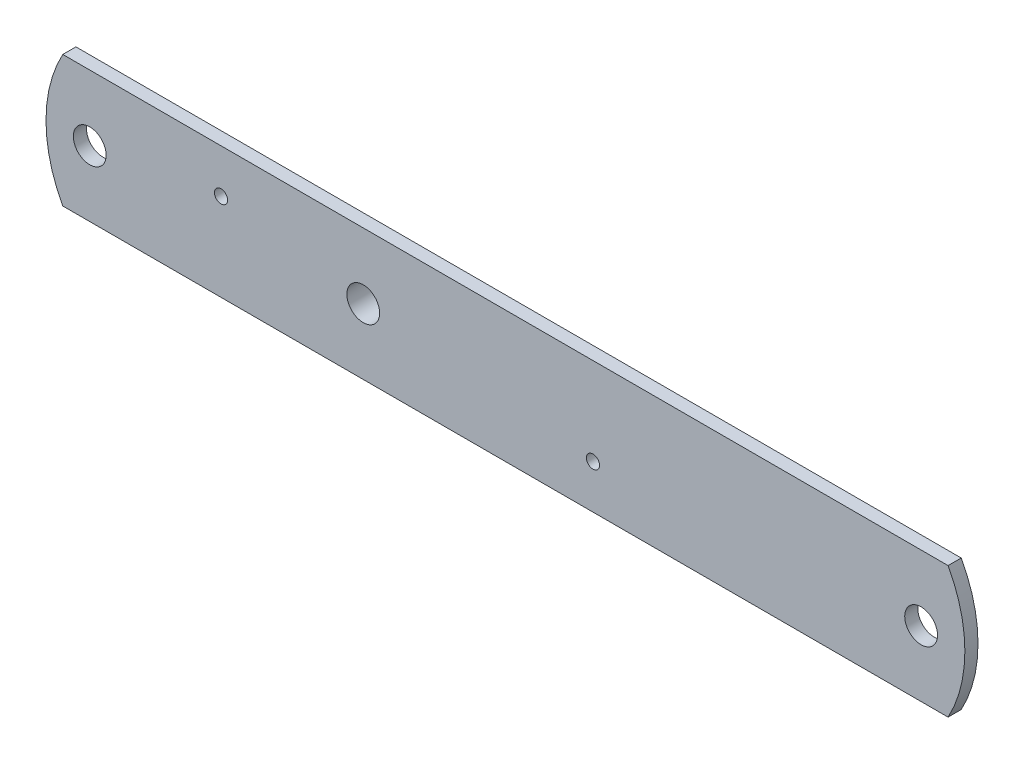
from build123d import *
from build123d.topology import SkipClean

# Parameters (mm, degrees)
ESQUISSE1_R             = 15
ESQUISSE1_R_2           = 6
EXTRUSION1_DEPTH        = 12
ESQUISSE2_W             = 100
ESQUISSE2_H             = 60
EXTRUSION2_DEPTH        = 10
ESQUISSE3_R             = 15
ENL_V_MAT_EXTRU_1_DEPTH = 849.813289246


with BuildPart() as part:
    # Esquisse1 → Extrusion1 (new body)
    with BuildSketch(Plane.XY):
        with BuildLine():
            Line((15.341439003, 0), (824.658560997, 0))
            ThreePointArc((824.658560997, 0), (840, -60), (824.658560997, -120))
            Line((824.658560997, -120), (15.341439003, -120))
            ThreePointArc((15.341439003, -120), (0, -60), (15.341439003, 0))
        make_face()
        with Locations((40, -60)):
            Circle(ESQUISSE1_R, mode=Mode.SUBTRACT)
        with Locations((160, -40)):
            Circle(ESQUISSE1_R_2, mode=Mode.SUBTRACT)
        with Locations((290, -60)):
            Circle(ESQUISSE1_R, mode=Mode.SUBTRACT)
        with Locations((800, -60)):
            Circle(ESQUISSE1_R, mode=Mode.SUBTRACT)
        with Locations((500, -80)):
            Circle(ESQUISSE1_R_2, mode=Mode.SUBTRACT)
    extrude(amount=EXTRUSION1_DEPTH)

    # Esquisse2 → Extrusion2 (add)
    with BuildSketch(Plane(origin=(0, 0, 0), x_dir=(-1, 0, 0), z_dir=(0, 0, -1))):
        with Locations((-290, -60)):
            Rectangle(ESQUISSE2_W, ESQUISSE2_H)
    extrude(amount=EXTRUSION2_DEPTH)

    # Esquisse3 → Enl_v. mat.-Extru.1 (cut, through all)
    with SkipClean():  # the faces are left unmerged after this step: merging them gives an invalid solid
        with BuildSketch(Plane(origin=(0, 0, -10), x_dir=(-1, 0, 0), z_dir=(0, 0, -1))):
            with Locations((-290, -60)):
                Circle(ESQUISSE3_R)
        extrude(amount=-ENL_V_MAT_EXTRU_1_DEPTH, mode=Mode.SUBTRACT)


solid = part.part
